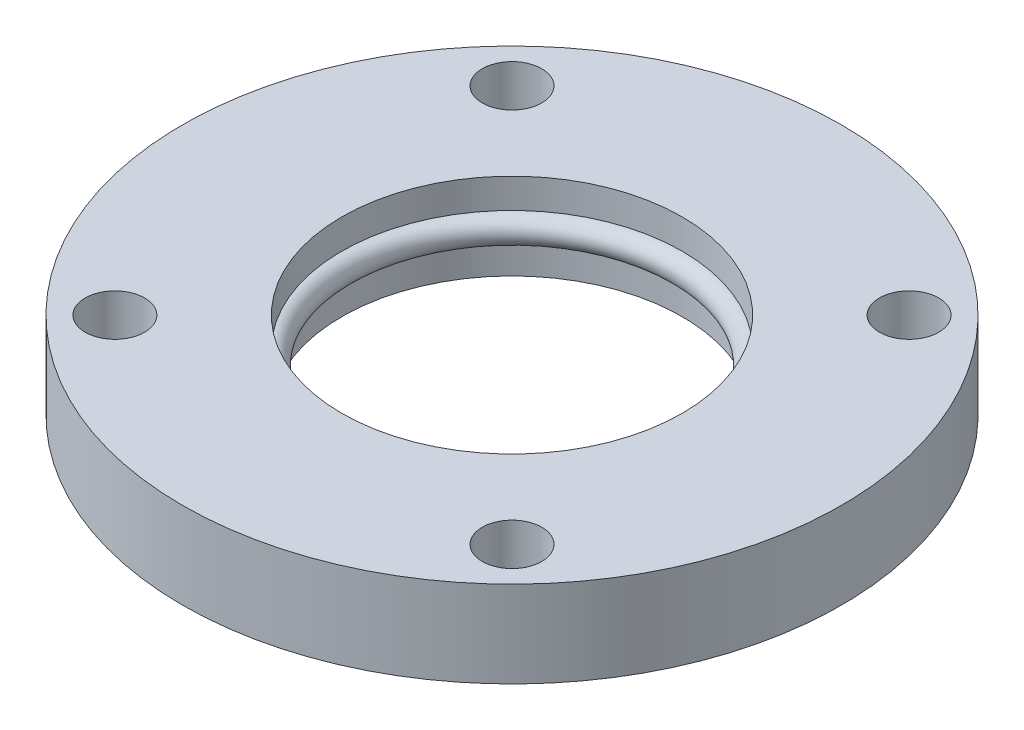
from build123d import *

# Parameters (mm, degrees)
SKETCH2_R           = 61
SKETCH2_R_2         = 31.5
SKETCH2_R_3         = 5.5
BOSS_EXTRUDE1_DEPTH = 8
SKETCH3_R           = 2.5


with BuildPart() as part:
    # Sketch2 → Boss-Extrude1 (new, symmetric)
    with BuildSketch(Plane(origin=(0, 0, 0), x_dir=(1, 0, 0), z_dir=(0, 1, 0))):
        with Locations(Location((0, 0, 0), (0, 0, 270))):
            Circle(SKETCH2_R)
        with Locations(Location((0, 0, 0), (0, 0, 270))):
            Circle(SKETCH2_R_2, mode=Mode.SUBTRACT)
        with Locations(Location((-36.75, 36.75, 0), (0, 0, 270))):
            Circle(SKETCH2_R_3, mode=Mode.SUBTRACT)
        with Locations(Location((36.75, 36.75, 0), (0, 0, 270))):
            Circle(SKETCH2_R_3, mode=Mode.SUBTRACT)
        with Locations(Location((36.75, -36.75, 0), (0, 0, 270))):
            Circle(SKETCH2_R_3, mode=Mode.SUBTRACT)
        with Locations(Location((-36.75, -36.75, 0), (0, 0, 270))):
            Circle(SKETCH2_R_3, mode=Mode.SUBTRACT)
    extrude(amount=BOSS_EXTRUDE1_DEPTH, both=True)

    # Sketch3 → Revolve2 (revolve)
    with BuildSketch(Plane.XY, mode=Mode.PRIVATE) as revolve2_sk:
        with Locations((-31.5, 0)):
            Circle(SKETCH3_R)
    revolve(revolve2_sk.sketch.rotate(Axis((0, 0, 0), (0, 1, 0)), 270), axis=Axis((0, 0, 0), (0, 1, 0)))


solid = part.part
